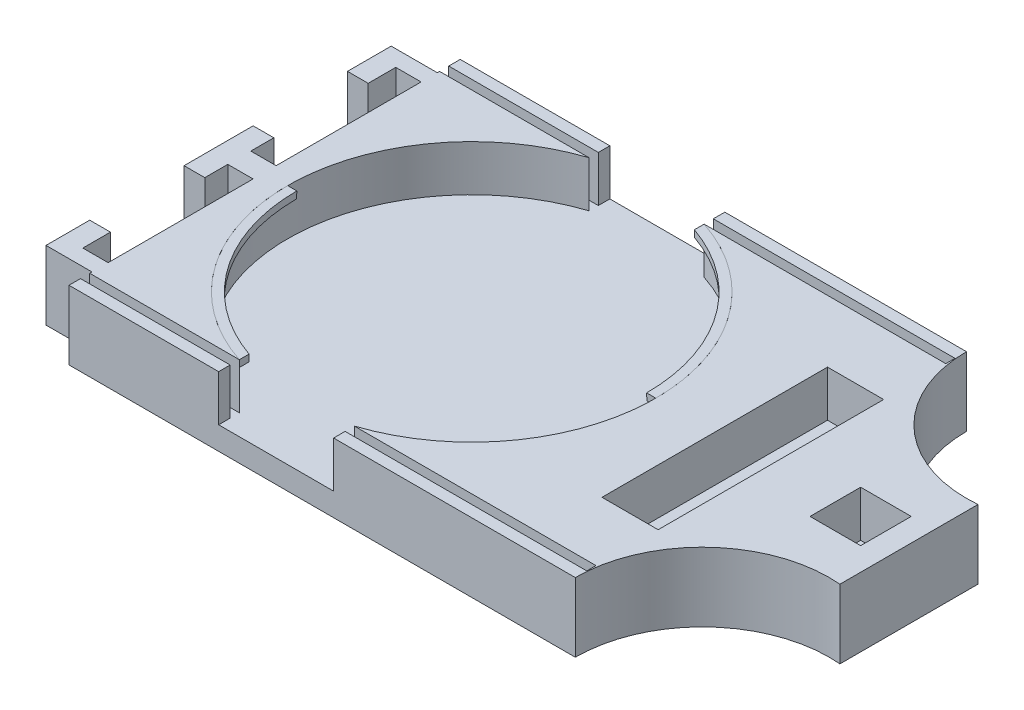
from build123d import *

# Parameters (mm, degrees)
SALIENTE_EXTRUIR1_DEPTH           = 15
CORTAR_EXTRUIR1_DEPTH             = 10
SALIENTE_EXTRUIR2_DEPTH           = 1.5
SALIENTE_EXTRUIR2_DRAFT           = -1
SALIENTE_EXTRUIR2_PROFILE_2_DEPTH = 1.5
SALIENTE_EXTRUIR2_PROFILE_2_DRAFT = -1


with BuildPart() as part:
    # Croquis2 → Saliente-Extruir1 (new body)
    with BuildSketch(Plane(origin=(0, 0, 0), x_dir=(1, 0, 0), z_dir=(0, 1, 0))):
        with BuildLine():
            Line((10, -80), (0, -80))
            Line((0, -80), (0, -70.5))
            Line((0, -70.5), (4.5, -70.5))
            Line((4.5, -70.5), (4.5, -76.5))
            Line((4.5, -76.5), (10, -76.5))
            Line((10, -76.5), (10, -45))
            Line((10, -45), (4.5, -45))
            Line((4.5, -45), (4.5, -50))
            Line((4.5, -50), (0, -50))
            Line((0, -50), (0, -35))
            Line((0, -35), (4.5, -35))
            Line((4.5, -35), (4.5, -40))
            Line((4.5, -40), (10, -40))
            Line((10, -40), (10, -8.5))
            Line((10, -8.5), (4.5, -8.5))
            Line((4.5, -8.5), (4.5, -14.5))
            Line((4.5, -14.5), (0, -14.5))
            Line((0, -14.5), (0, -5))
            Line((0, -5), (10, -5))
            Line((10, -5), (10, 0))
            Line((10, 0), (120, 0))
            ThreePointArc((120, 0), (128.9513514, -20.348525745), (150, -27.5))
            Line((150, -27.5), (150, -42.5))
            Line((150, -42.5), (150, -57.5))
            ThreePointArc((150, -57.5), (128.9513514, -64.651474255), (120, -85))
            Line((120, -85), (10, -85))
            Line((10, -85), (10, -80))
        make_face()
    extrude(amount=SALIENTE_EXTRUIR1_DEPTH)

    # Croquis3 → Cortar-Extruir1 (cut)
    with BuildSketch(Plane(origin=(0, 15, 0), x_dir=(1, 0, 0), z_dir=(0, 1, 0))):
        with BuildLine():
            Line((10, -82.5), (10, -80.5))
            Line((10, -80.5), (42.510004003, -80.5))
            ThreePointArc((42.510004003, -80.5), (15, -42.5), (42.510004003, -4.5))
            Line((42.510004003, -4.5), (10, -4.5))
            Line((10, -4.5), (10, -2.5))
            Line((10, -2.5), (42.510004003, -2.5))
            Line((42.510004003, -2.5), (42.510004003, 0))
            Line((42.510004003, 0), (67.489995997, 0))
            Line((67.489995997, 0), (67.489995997, -2.5))
            Line((67.489995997, -2.5), (120, -2.5))
            Line((120, -2.5), (120, -4.5))
            Line((120, -4.5), (67.489995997, -4.5))
            ThreePointArc((67.489995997, -4.5), (95, -42.5), (67.489995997, -80.5))
            Line((67.489995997, -80.5), (120, -80.5))
            Line((120, -80.5), (120, -82.5))
            Line((120, -82.5), (67.489995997, -82.5))
            Line((67.489995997, -82.5), (67.489995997, -85))
            Line((67.489995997, -85), (42.510004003, -85))
            Line((42.510004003, -85), (42.510004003, -82.5))
            Line((42.510004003, -82.5), (10, -82.5))
        make_face()
        Polygon((120, -42.5), (120, -67), (107.8, -67), (107.8, -18), (120, -18), align=None)
        Polygon((145, -42.5), (145, -48), (134, -48), (134, -37), (145, -37), align=None)
    extrude(amount=-CORTAR_EXTRUIR1_DEPTH, mode=Mode.SUBTRACT)


with BuildPart() as body_2:
    # Croquis4 → Saliente-Extruir2 (with draft: the straight prism first)
    with BuildSketch(Plane(origin=(0, 15, 0), x_dir=(1, 0, 0), z_dir=(0, 1, 0))):
        with BuildLine():
            Line((67.489995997, -4.5), (67.489995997, -6.61128311))
            ThreePointArc((67.489995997, -6.61128311), (85.972728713, -20.484322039), (93, -42.5))
            Line((93, -42.5), (95, -42.5))
            ThreePointArc((95, -42.5), (87.400616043, -19.043655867), (67.489995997, -4.5))
        make_face()
    extrude(amount=-SALIENTE_EXTRUIR2_DEPTH)
    # Saliente-Extruir2: the draft: its side faces are tilted about the plane it starts from
    saliente_extruir2_sides = [body_2.faces().sort_by_distance(p)[0] for p in [
        (67.489995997, 14.25, 5.555641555),
        (85.972728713, 14.25, 20.484322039),
        (94, 14.25, 42.5),
        (87.400616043, 14.25, 19.043655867),
    ]]
    draft(saliente_extruir2_sides, Plane(origin=(0, 15, 0), x_dir=(1, 0, 0), z_dir=(0, 1, 0)), SALIENTE_EXTRUIR2_DRAFT)


with BuildPart() as body_3:
    # Croquis4 → Saliente-Extruir2 profile 2 (with draft: the straight prism first)
    with BuildSketch(Plane(origin=(0, 15, 0), x_dir=(1, 0, 0), z_dir=(0, 1, 0))):
        with BuildLine():
            Line((42.510004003, -80.5), (42.510004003, -78.38871689))
            ThreePointArc((42.510004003, -78.38871689), (24.027271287, -64.515677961), (17, -42.5))
            Line((17, -42.5), (15, -42.5))
            ThreePointArc((15, -42.5), (22.599383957, -65.956344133), (42.510004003, -80.5))
        make_face()
    extrude(amount=-SALIENTE_EXTRUIR2_PROFILE_2_DEPTH)
    # Saliente-Extruir2 profile 2: the draft: its side faces are tilted about the plane it starts from
    saliente_extruir2_profile_2_sides = [body_3.faces().sort_by_distance(p)[0] for p in [
        (42.510004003, 14.25, 79.444358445),
        (24.027271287, 14.25, 64.515677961),
        (16, 14.25, 42.5),
        (22.599383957, 14.25, 65.956344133),
    ]]
    draft(saliente_extruir2_profile_2_sides, Plane(origin=(0, 15, 0), x_dir=(1, 0, 0), z_dir=(0, 1, 0)), SALIENTE_EXTRUIR2_PROFILE_2_DRAFT)


solid = Compound([part.part, body_2.part, body_3.part])
